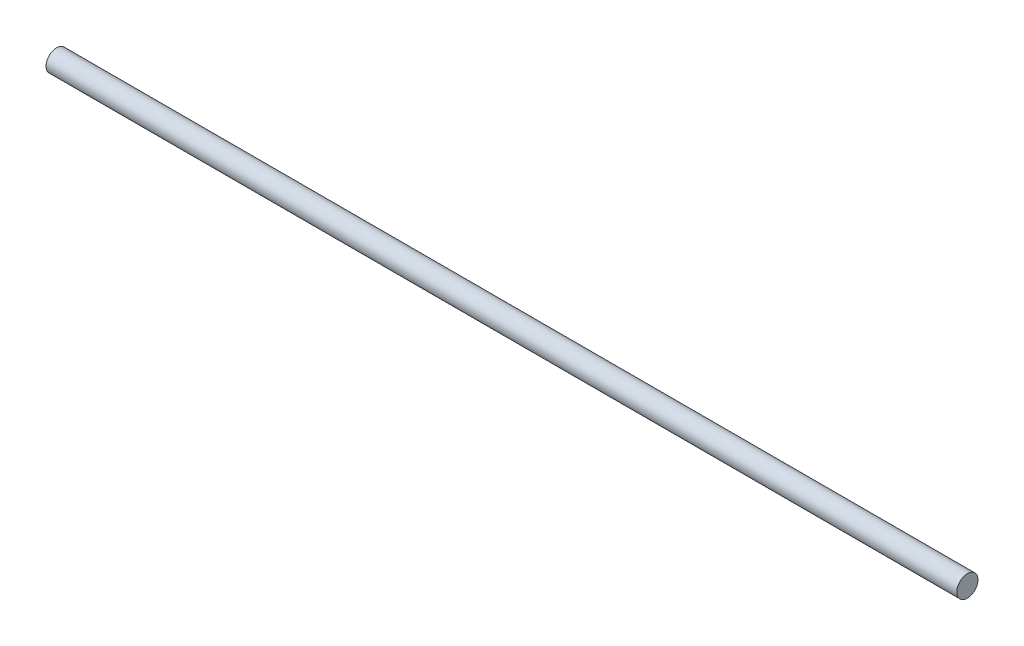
from build123d import *

# Parameters (mm, degrees)
EXTRUDE1_DEPTH      = 500
EXTRUDE1_DEPTH_BACK = 100
SKETCH1_R           = 7


with BuildPart() as part:
    # Sketch1 → Extrude1 (new, two sides: drawn at the far end of the back side and taken through both)
    with BuildSketch(Plane(origin=(0, 0, 0), x_dir=(0, 0, -1), z_dir=(1, 0, 0)).offset(-EXTRUDE1_DEPTH_BACK)):
        Circle(SKETCH1_R)
    extrude(amount=EXTRUDE1_DEPTH + EXTRUDE1_DEPTH_BACK)


solid = part.part
